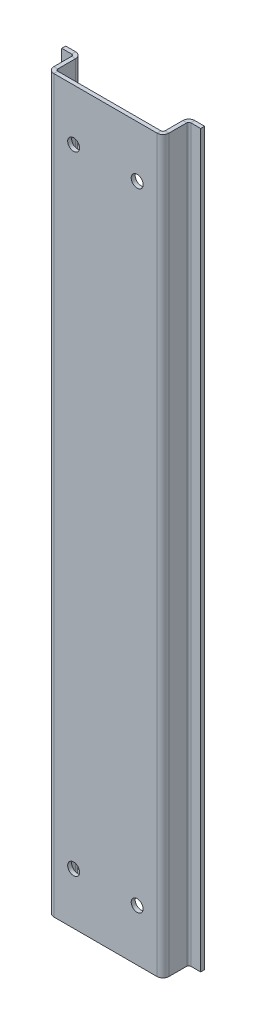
ISO-10303-21;
HEADER;
FILE_DESCRIPTION(('STEP AP214'),'2;1');
FILE_NAME('part.step','',(''),(''),'','','');
FILE_SCHEMA(('AUTOMOTIVE_DESIGN { 1 0 10303 214 1 1 1 1 }'));
ENDSEC;
DATA;
#1=APPLICATION_CONTEXT('core data for automotive mechanical design processes');
#2=APPLICATION_PROTOCOL_DEFINITION('international standard','automotive_design',2000,#1);
#3=PRODUCT_CONTEXT('',#1,'mechanical');
#4=PRODUCT('Part','Part','',(#3));
#5=PRODUCT_RELATED_PRODUCT_CATEGORY('part','',(#4));
#6=PRODUCT_DEFINITION_FORMATION('','',#4);
#7=PRODUCT_DEFINITION_CONTEXT('part definition',#1,'design');
#8=PRODUCT_DEFINITION('design','',#6,#7);
#9=PRODUCT_DEFINITION_SHAPE('','',#8);
#10=(LENGTH_UNIT() NAMED_UNIT(*) SI_UNIT(.MILLI.,.METRE.));
#11=(NAMED_UNIT(*) PLANE_ANGLE_UNIT() SI_UNIT($,.RADIAN.));
#12=(NAMED_UNIT(*) SI_UNIT($,.STERADIAN.) SOLID_ANGLE_UNIT());
#13=UNCERTAINTY_MEASURE_WITH_UNIT(LENGTH_MEASURE(1.E-05),#10,'distance_accuracy_value','');
#14=(GEOMETRIC_REPRESENTATION_CONTEXT(3) GLOBAL_UNCERTAINTY_ASSIGNED_CONTEXT((#13)) GLOBAL_UNIT_ASSIGNED_CONTEXT((#10,
#11,#12)) REPRESENTATION_CONTEXT('',''));
#15=CARTESIAN_POINT('',(0.,0.,0.));
#16=DIRECTION('',(0.,0.,1.));
#17=DIRECTION('',(1.,0.,0.));
#18=AXIS2_PLACEMENT_3D('',#15,#16,#17);
#19=CARTESIAN_POINT('',(0.,0.,-7.5));
#20=DIRECTION('',(0.,-1.,0.));
#21=DIRECTION('',(0.,0.,-1.));
#22=AXIS2_PLACEMENT_3D('',#19,#20,#21);
#23=PLANE('',#22);
#24=DIRECTION('',(0.,0.,-1.));
#25=VECTOR('',#24,1.);
#26=CARTESIAN_POINT('',(0.,0.,-7.5));
#27=LINE('',#26,#25);
#28=CARTESIAN_POINT('',(0.,0.,-1.49999999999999));
#29=VERTEX_POINT('',#28);
#30=CARTESIAN_POINT('',(0.,0.,-6.));
#31=VERTEX_POINT('',#30);
#32=EDGE_CURVE('E418',#29,#31,#27,.T.);
#33=ORIENTED_EDGE('',*,*,#32,.T.);
#34=DIRECTION('',(1.,0.,0.));
#35=VECTOR('',#34,1.);
#36=CARTESIAN_POINT('',(0.,0.,-6.));
#37=LINE('',#36,#35);
#38=CARTESIAN_POINT('',(0.999999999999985,0.,-6.00000000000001));
#39=VERTEX_POINT('',#38);
#40=EDGE_CURVE('E305',#31,#39,#37,.T.);
#41=ORIENTED_EDGE('',*,*,#40,.T.);
#42=DIRECTION('',(0.,0.,1.));
#43=VECTOR('',#42,1.);
#44=CARTESIAN_POINT('',(1.,0.,-1.));
#45=LINE('',#44,#43);
#46=CARTESIAN_POINT('',(0.999999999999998,0.,-1.5));
#47=VERTEX_POINT('',#46);
#48=EDGE_CURVE('E422',#47,#39,#45,.F.);
#49=ORIENTED_EDGE('',*,*,#48,.F.);
#50=DIRECTION('',(-1.,0.,0.));
#51=VECTOR('',#50,1.);
#52=CARTESIAN_POINT('',(0.,0.,-1.49999999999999));
#53=LINE('',#52,#51);
#54=EDGE_CURVE('E412',#47,#29,#53,.T.);
#55=ORIENTED_EDGE('',*,*,#54,.T.);
#56=EDGE_LOOP('',(#33,#41,#49,#55));
#57=FACE_BOUND('',#56,.T.);
#58=ADVANCED_FACE('F116',(#57),#23,.T.);
#59=CARTESIAN_POINT('',(0.,184.,-0.999999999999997));
#60=DIRECTION('',(-1.,0.,0.));
#61=DIRECTION('',(0.,0.,1.));
#62=AXIS2_PLACEMENT_3D('',#59,#60,#61);
#63=PLANE('',#62);
#64=DIRECTION('',(0.,0.,1.));
#65=VECTOR('',#64,1.);
#66=CARTESIAN_POINT('',(0.,184.,-0.999999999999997));
#67=LINE('',#66,#65);
#68=CARTESIAN_POINT('',(0.,184.,-6.));
#69=VERTEX_POINT('',#68);
#70=CARTESIAN_POINT('',(0.,184.,-1.49999999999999));
#71=VERTEX_POINT('',#70);
#72=EDGE_CURVE('E415',#69,#71,#67,.T.);
#73=ORIENTED_EDGE('',*,*,#72,.F.);
#74=DIRECTION('',(0.,-1.,0.));
#75=VECTOR('',#74,1.);
#76=CARTESIAN_POINT('',(0.,0.,-6.));
#77=LINE('',#76,#75);
#78=EDGE_CURVE('E140',#31,#69,#77,.F.);
#79=ORIENTED_EDGE('',*,*,#78,.F.);
#80=ORIENTED_EDGE('',*,*,#32,.F.);
#81=DIRECTION('',(0.,1.,0.));
#82=VECTOR('',#81,1.);
#83=CARTESIAN_POINT('',(0.,184.,-1.49999999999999));
#84=LINE('',#83,#82);
#85=EDGE_CURVE('E425',#29,#71,#84,.T.);
#86=ORIENTED_EDGE('',*,*,#85,.T.);
#87=EDGE_LOOP('',(#73,#79,#80,#86));
#88=FACE_BOUND('',#87,.T.);
#89=ADVANCED_FACE('F524',(#88),#63,.T.);
#90=CARTESIAN_POINT('',(1.,184.,-1.));
#91=DIRECTION('',(-1.,0.,0.));
#92=DIRECTION('',(0.,0.,1.));
#93=AXIS2_PLACEMENT_3D('',#90,#91,#92);
#94=PLANE('',#93);
#95=DIRECTION('',(0.,-1.,0.));
#96=VECTOR('',#95,1.);
#97=CARTESIAN_POINT('',(0.999999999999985,0.,-6.00000000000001));
#98=LINE('',#97,#96);
#99=CARTESIAN_POINT('',(0.999999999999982,184.,-6.));
#100=VERTEX_POINT('',#99);
#101=EDGE_CURVE('E299',#39,#100,#98,.F.);
#102=ORIENTED_EDGE('',*,*,#101,.T.);
#103=DIRECTION('',(0.,0.,-1.));
#104=VECTOR('',#103,1.);
#105=CARTESIAN_POINT('',(1.,184.,-1.));
#106=LINE('',#105,#104);
#107=CARTESIAN_POINT('',(0.999999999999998,184.,-1.5));
#108=VERTEX_POINT('',#107);
#109=EDGE_CURVE('E420',#100,#108,#106,.F.);
#110=ORIENTED_EDGE('',*,*,#109,.T.);
#111=DIRECTION('',(0.,-1.,0.));
#112=VECTOR('',#111,1.);
#113=CARTESIAN_POINT('',(0.999999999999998,0.,-1.5));
#114=LINE('',#113,#112);
#115=EDGE_CURVE('E431',#47,#108,#114,.F.);
#116=ORIENTED_EDGE('',*,*,#115,.F.);
#117=ORIENTED_EDGE('',*,*,#48,.T.);
#118=EDGE_LOOP('',(#102,#110,#116,#117));
#119=FACE_BOUND('',#118,.T.);
#120=ADVANCED_FACE('F505',(#119),#94,.F.);
#121=CARTESIAN_POINT('',(29.,184.,-7.5));
#122=DIRECTION('',(0.,1.,0.));
#123=DIRECTION('',(-1.,0.,0.));
#124=AXIS2_PLACEMENT_3D('',#121,#122,#123);
#125=PLANE('',#124);
#126=DIRECTION('',(0.,0.,-1.));
#127=VECTOR('',#126,1.);
#128=CARTESIAN_POINT('',(29.,184.,-7.5));
#129=LINE('',#128,#127);
#130=CARTESIAN_POINT('',(29.,184.,-1.49999999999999));
#131=VERTEX_POINT('',#130);
#132=CARTESIAN_POINT('',(29.,184.,-6.));
#133=VERTEX_POINT('',#132);
#134=EDGE_CURVE('E373',#131,#133,#129,.T.);
#135=ORIENTED_EDGE('',*,*,#134,.T.);
#136=DIRECTION('',(-1.,0.,0.));
#137=VECTOR('',#136,1.);
#138=CARTESIAN_POINT('',(29.,184.,-6.));
#139=LINE('',#138,#137);
#140=CARTESIAN_POINT('',(28.,184.,-6.00000000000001));
#141=VERTEX_POINT('',#140);
#142=EDGE_CURVE('E354',#133,#141,#139,.T.);
#143=ORIENTED_EDGE('',*,*,#142,.T.);
#144=DIRECTION('',(0.,0.,1.));
#145=VECTOR('',#144,1.);
#146=CARTESIAN_POINT('',(28.,184.,-1.));
#147=LINE('',#146,#145);
#148=CARTESIAN_POINT('',(28.,184.,-1.5));
#149=VERTEX_POINT('',#148);
#150=EDGE_CURVE('E378',#149,#141,#147,.F.);
#151=ORIENTED_EDGE('',*,*,#150,.F.);
#152=DIRECTION('',(1.,0.,0.));
#153=VECTOR('',#152,1.);
#154=CARTESIAN_POINT('',(29.,184.,-1.49999999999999));
#155=LINE('',#154,#153);
#156=EDGE_CURVE('E368',#149,#131,#155,.T.);
#157=ORIENTED_EDGE('',*,*,#156,.T.);
#158=EDGE_LOOP('',(#135,#143,#151,#157));
#159=FACE_BOUND('',#158,.T.);
#160=ADVANCED_FACE('F582',(#159),#125,.T.);
#161=CARTESIAN_POINT('',(29.,0.,-0.999999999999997));
#162=DIRECTION('',(1.,0.,0.));
#163=DIRECTION('',(0.,0.,-1.));
#164=AXIS2_PLACEMENT_3D('',#161,#162,#163);
#165=PLANE('',#164);
#166=DIRECTION('',(0.,0.,1.));
#167=VECTOR('',#166,1.);
#168=CARTESIAN_POINT('',(29.,0.,-0.999999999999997));
#169=LINE('',#168,#167);
#170=CARTESIAN_POINT('',(29.,0.,-6.));
#171=VERTEX_POINT('',#170);
#172=CARTESIAN_POINT('',(29.,0.,-1.49999999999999));
#173=VERTEX_POINT('',#172);
#174=EDGE_CURVE('E370',#171,#173,#169,.T.);
#175=ORIENTED_EDGE('',*,*,#174,.F.);
#176=DIRECTION('',(0.,1.,0.));
#177=VECTOR('',#176,1.);
#178=CARTESIAN_POINT('',(29.,184.,-6.));
#179=LINE('',#178,#177);
#180=EDGE_CURVE('E360',#133,#171,#179,.F.);
#181=ORIENTED_EDGE('',*,*,#180,.F.);
#182=ORIENTED_EDGE('',*,*,#134,.F.);
#183=DIRECTION('',(0.,-1.,0.));
#184=VECTOR('',#183,1.);
#185=CARTESIAN_POINT('',(29.,0.,-1.49999999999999));
#186=LINE('',#185,#184);
#187=EDGE_CURVE('E381',#131,#173,#186,.T.);
#188=ORIENTED_EDGE('',*,*,#187,.T.);
#189=EDGE_LOOP('',(#175,#181,#182,#188));
#190=FACE_BOUND('',#189,.T.);
#191=ADVANCED_FACE('F586',(#190),#165,.T.);
#192=CARTESIAN_POINT('',(28.,0.,-1.));
#193=DIRECTION('',(1.,0.,0.));
#194=DIRECTION('',(0.,0.,-1.));
#195=AXIS2_PLACEMENT_3D('',#192,#193,#194);
#196=PLANE('',#195);
#197=DIRECTION('',(0.,1.,0.));
#198=VECTOR('',#197,1.);
#199=CARTESIAN_POINT('',(28.,184.,-6.00000000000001));
#200=LINE('',#199,#198);
#201=CARTESIAN_POINT('',(28.,0.,-6.));
#202=VERTEX_POINT('',#201);
#203=EDGE_CURVE('E348',#141,#202,#200,.F.);
#204=ORIENTED_EDGE('',*,*,#203,.T.);
#205=DIRECTION('',(0.,0.,-1.));
#206=VECTOR('',#205,1.);
#207=CARTESIAN_POINT('',(28.,0.,-1.));
#208=LINE('',#207,#206);
#209=CARTESIAN_POINT('',(28.,0.,-1.5));
#210=VERTEX_POINT('',#209);
#211=EDGE_CURVE('E376',#202,#210,#208,.F.);
#212=ORIENTED_EDGE('',*,*,#211,.T.);
#213=DIRECTION('',(0.,1.,0.));
#214=VECTOR('',#213,1.);
#215=CARTESIAN_POINT('',(28.,184.,-1.5));
#216=LINE('',#215,#214);
#217=EDGE_CURVE('E387',#149,#210,#216,.F.);
#218=ORIENTED_EDGE('',*,*,#217,.F.);
#219=ORIENTED_EDGE('',*,*,#150,.T.);
#220=EDGE_LOOP('',(#204,#212,#218,#219));
#221=FACE_BOUND('',#220,.T.);
#222=ADVANCED_FACE('F555',(#221),#196,.F.);
#223=CARTESIAN_POINT('',(0.,184.,-1.));
#224=DIRECTION('',(0.,0.,-1.));
#225=DIRECTION('',(-1.,0.,0.));
#226=AXIS2_PLACEMENT_3D('',#223,#224,#225);
#227=PLANE('',#226);
#228=CARTESIAN_POINT('',(22.5000000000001,171.,-1.));
#229=DIRECTION('',(0.,0.,-1.));
#230=DIRECTION('',(1.,0.,0.));
#231=AXIS2_PLACEMENT_3D('',#228,#229,#230);
#232=CIRCLE('',#231,1.5);
#233=CARTESIAN_POINT('',(24.0000000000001,171.,-1.));
#234=VERTEX_POINT('',#233);
#235=EDGE_CURVE('E482',#234,#234,#232,.T.);
#236=ORIENTED_EDGE('',*,*,#235,.F.);
#237=EDGE_LOOP('',(#236));
#238=FACE_BOUND('',#237,.T.);
#239=CARTESIAN_POINT('',(6.50000000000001,171.,-1.));
#240=DIRECTION('',(0.,0.,-1.));
#241=DIRECTION('',(-1.,0.,0.));
#242=AXIS2_PLACEMENT_3D('',#239,#240,#241);
#243=CIRCLE('',#242,1.5);
#244=CARTESIAN_POINT('',(5.00000000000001,171.,-1.));
#245=VERTEX_POINT('',#244);
#246=EDGE_CURVE('E472',#245,#245,#243,.T.);
#247=ORIENTED_EDGE('',*,*,#246,.F.);
#248=EDGE_LOOP('',(#247));
#249=FACE_BOUND('',#248,.T.);
#250=CARTESIAN_POINT('',(6.49999999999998,13.,-1.));
#251=DIRECTION('',(0.,0.,-1.));
#252=DIRECTION('',(1.,0.,0.));
#253=AXIS2_PLACEMENT_3D('',#250,#251,#252);
#254=CIRCLE('',#253,1.5);
#255=CARTESIAN_POINT('',(7.99999999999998,13.,-1.));
#256=VERTEX_POINT('',#255);
#257=EDGE_CURVE('E469',#256,#256,#254,.T.);
#258=ORIENTED_EDGE('',*,*,#257,.F.);
#259=EDGE_LOOP('',(#258));
#260=FACE_BOUND('',#259,.T.);
#261=CARTESIAN_POINT('',(22.5,13.,-1.));
#262=DIRECTION('',(0.,0.,-1.));
#263=DIRECTION('',(-1.,0.,0.));
#264=AXIS2_PLACEMENT_3D('',#261,#262,#263);
#265=CIRCLE('',#264,1.5);
#266=CARTESIAN_POINT('',(21.,13.,-1.));
#267=VERTEX_POINT('',#266);
#268=EDGE_CURVE('E466',#267,#267,#265,.T.);
#269=ORIENTED_EDGE('',*,*,#268,.F.);
#270=EDGE_LOOP('',(#269));
#271=FACE_BOUND('',#270,.T.);
#272=DIRECTION('',(-1.,0.,0.));
#273=VECTOR('',#272,1.);
#274=CARTESIAN_POINT('',(0.,184.,-1.));
#275=LINE('',#274,#273);
#276=CARTESIAN_POINT('',(27.5,184.,-0.999999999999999));
#277=VERTEX_POINT('',#276);
#278=CARTESIAN_POINT('',(1.5,184.,-1.));
#279=VERTEX_POINT('',#278);
#280=EDGE_CURVE('E13',#277,#279,#275,.T.);
#281=ORIENTED_EDGE('',*,*,#280,.F.);
#282=DIRECTION('',(0.,-1.,0.));
#283=VECTOR('',#282,1.);
#284=CARTESIAN_POINT('',(27.5,0.,-0.999999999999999));
#285=LINE('',#284,#283);
#286=CARTESIAN_POINT('',(27.5,0.,-0.999999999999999));
#287=VERTEX_POINT('',#286);
#288=EDGE_CURVE('E404',#287,#277,#285,.F.);
#289=ORIENTED_EDGE('',*,*,#288,.F.);
#290=DIRECTION('',(1.,0.,0.));
#291=VECTOR('',#290,1.);
#292=CARTESIAN_POINT('',(0.,0.,-1.));
#293=LINE('',#292,#291);
#294=CARTESIAN_POINT('',(1.5,0.,-1.));
#295=VERTEX_POINT('',#294);
#296=EDGE_CURVE('E125',#295,#287,#293,.T.);
#297=ORIENTED_EDGE('',*,*,#296,.F.);
#298=DIRECTION('',(0.,1.,0.));
#299=VECTOR('',#298,1.);
#300=CARTESIAN_POINT('',(1.5,184.,-1.));
#301=LINE('',#300,#299);
#302=EDGE_CURVE('E448',#279,#295,#301,.F.);
#303=ORIENTED_EDGE('',*,*,#302,.F.);
#304=EDGE_LOOP('',(#281,#289,#297,#303));
#305=FACE_BOUND('',#304,.T.);
#306=ADVANCED_FACE('F551',(#238,#249,#260,#271,#305),#227,.T.);
#307=CARTESIAN_POINT('',(0.,184.,0.));
#308=DIRECTION('',(0.,0.,-1.));
#309=DIRECTION('',(-1.,0.,0.));
#310=AXIS2_PLACEMENT_3D('',#307,#308,#309);
#311=PLANE('',#310);
#312=CARTESIAN_POINT('',(22.5000000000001,171.,0.));
#313=DIRECTION('',(0.,0.,-1.));
#314=DIRECTION('',(-1.,0.,0.));
#315=AXIS2_PLACEMENT_3D('',#312,#313,#314);
#316=CIRCLE('',#315,1.5);
#317=CARTESIAN_POINT('',(21.0000000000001,171.,0.));
#318=VERTEX_POINT('',#317);
#319=EDGE_CURVE('E120',#318,#318,#316,.T.);
#320=ORIENTED_EDGE('',*,*,#319,.T.);
#321=EDGE_LOOP('',(#320));
#322=FACE_BOUND('',#321,.T.);
#323=CARTESIAN_POINT('',(6.50000000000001,171.,0.));
#324=DIRECTION('',(0.,0.,-1.));
#325=DIRECTION('',(-1.,0.,0.));
#326=AXIS2_PLACEMENT_3D('',#323,#324,#325);
#327=CIRCLE('',#326,1.5);
#328=CARTESIAN_POINT('',(5.00000000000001,171.,0.));
#329=VERTEX_POINT('',#328);
#330=EDGE_CURVE('E470',#329,#329,#327,.T.);
#331=ORIENTED_EDGE('',*,*,#330,.T.);
#332=EDGE_LOOP('',(#331));
#333=FACE_BOUND('',#332,.T.);
#334=CARTESIAN_POINT('',(6.49999999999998,13.,0.));
#335=DIRECTION('',(0.,0.,-1.));
#336=DIRECTION('',(-1.,0.,0.));
#337=AXIS2_PLACEMENT_3D('',#334,#335,#336);
#338=CIRCLE('',#337,1.5);
#339=CARTESIAN_POINT('',(4.99999999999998,13.,0.));
#340=VERTEX_POINT('',#339);
#341=EDGE_CURVE('E467',#340,#340,#338,.T.);
#342=ORIENTED_EDGE('',*,*,#341,.T.);
#343=EDGE_LOOP('',(#342));
#344=FACE_BOUND('',#343,.T.);
#345=CARTESIAN_POINT('',(22.5,13.,0.));
#346=DIRECTION('',(0.,0.,-1.));
#347=DIRECTION('',(-1.,0.,0.));
#348=AXIS2_PLACEMENT_3D('',#345,#346,#347);
#349=CIRCLE('',#348,1.5);
#350=CARTESIAN_POINT('',(21.,13.,0.));
#351=VERTEX_POINT('',#350);
#352=EDGE_CURVE('E298',#351,#351,#349,.T.);
#353=ORIENTED_EDGE('',*,*,#352,.T.);
#354=EDGE_LOOP('',(#353));
#355=FACE_BOUND('',#354,.T.);
#356=DIRECTION('',(0.,-1.,0.));
#357=VECTOR('',#356,1.);
#358=CARTESIAN_POINT('',(27.5,0.,0.));
#359=LINE('',#358,#357);
#360=CARTESIAN_POINT('',(27.5,0.,0.));
#361=VERTEX_POINT('',#360);
#362=CARTESIAN_POINT('',(27.5,184.,0.));
#363=VERTEX_POINT('',#362);
#364=EDGE_CURVE('E392',#361,#363,#359,.F.);
#365=ORIENTED_EDGE('',*,*,#364,.T.);
#366=DIRECTION('',(-1.,0.,0.));
#367=VECTOR('',#366,1.);
#368=CARTESIAN_POINT('',(0.,184.,0.));
#369=LINE('',#368,#367);
#370=CARTESIAN_POINT('',(1.5,184.,0.));
#371=VERTEX_POINT('',#370);
#372=EDGE_CURVE('E460',#363,#371,#369,.T.);
#373=ORIENTED_EDGE('',*,*,#372,.T.);
#374=DIRECTION('',(0.,1.,0.));
#375=VECTOR('',#374,1.);
#376=CARTESIAN_POINT('',(1.5,184.,0.));
#377=LINE('',#376,#375);
#378=CARTESIAN_POINT('',(1.5,0.,0.));
#379=VERTEX_POINT('',#378);
#380=EDGE_CURVE('E436',#371,#379,#377,.F.);
#381=ORIENTED_EDGE('',*,*,#380,.T.);
#382=DIRECTION('',(1.,0.,0.));
#383=VECTOR('',#382,1.);
#384=CARTESIAN_POINT('',(0.,0.,0.));
#385=LINE('',#384,#383);
#386=EDGE_CURVE('E456',#379,#361,#385,.T.);
#387=ORIENTED_EDGE('',*,*,#386,.T.);
#388=EDGE_LOOP('',(#365,#373,#381,#387));
#389=FACE_BOUND('',#388,.T.);
#390=ADVANCED_FACE('F554',(#322,#333,#344,#355,#389),#311,.F.);
#391=CARTESIAN_POINT('',(0.,0.,-1.));
#392=DIRECTION('',(0.,-1.,0.));
#393=DIRECTION('',(0.,0.,-1.));
#394=AXIS2_PLACEMENT_3D('',#391,#392,#393);
#395=PLANE('',#394);
#396=ORIENTED_EDGE('',*,*,#296,.T.);
#397=DIRECTION('',(0.,0.,1.));
#398=VECTOR('',#397,1.);
#399=CARTESIAN_POINT('',(27.5,0.,-0.999999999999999));
#400=LINE('',#399,#398);
#401=EDGE_CURVE('E398',#287,#361,#400,.T.);
#402=ORIENTED_EDGE('',*,*,#401,.T.);
#403=ORIENTED_EDGE('',*,*,#386,.F.);
#404=DIRECTION('',(0.,0.,1.));
#405=VECTOR('',#404,1.);
#406=CARTESIAN_POINT('',(1.5,0.,-1.));
#407=LINE('',#406,#405);
#408=EDGE_CURVE('E453',#295,#379,#407,.T.);
#409=ORIENTED_EDGE('',*,*,#408,.F.);
#410=EDGE_LOOP('',(#396,#402,#403,#409));
#411=FACE_BOUND('',#410,.T.);
#412=ADVANCED_FACE('F118',(#411),#395,.T.);
#413=CARTESIAN_POINT('',(0.,184.,-1.));
#414=DIRECTION('',(0.,1.,0.));
#415=DIRECTION('',(0.,0.,1.));
#416=AXIS2_PLACEMENT_3D('',#413,#414,#415);
#417=PLANE('',#416);
#418=DIRECTION('',(0.,0.,1.));
#419=VECTOR('',#418,1.);
#420=CARTESIAN_POINT('',(27.5,184.,-0.999999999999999));
#421=LINE('',#420,#419);
#422=EDGE_CURVE('E409',#277,#363,#421,.T.);
#423=ORIENTED_EDGE('',*,*,#422,.F.);
#424=ORIENTED_EDGE('',*,*,#280,.T.);
#425=DIRECTION('',(0.,0.,1.));
#426=VECTOR('',#425,1.);
#427=CARTESIAN_POINT('',(1.5,184.,-1.));
#428=LINE('',#427,#426);
#429=EDGE_CURVE('E442',#279,#371,#428,.T.);
#430=ORIENTED_EDGE('',*,*,#429,.T.);
#431=ORIENTED_EDGE('',*,*,#372,.F.);
#432=EDGE_LOOP('',(#423,#424,#430,#431));
#433=FACE_BOUND('',#432,.T.);
#434=ADVANCED_FACE('F546',(#433),#417,.T.);
#435=CARTESIAN_POINT('',(1.5,0.,-1.5));
#436=DIRECTION('',(0.,-1.,0.));
#437=DIRECTION('',(0.,0.,-1.));
#438=AXIS2_PLACEMENT_3D('',#435,#436,#437);
#439=PLANE('',#438);
#440=ORIENTED_EDGE('',*,*,#54,.F.);
#441=CARTESIAN_POINT('',(1.5,0.,-1.5));
#442=DIRECTION('',(0.,1.,0.));
#443=DIRECTION('',(0.,0.,1.));
#444=AXIS2_PLACEMENT_3D('',#441,#442,#443);
#445=CIRCLE('',#444,0.5);
#446=EDGE_CURVE('E445',#295,#47,#445,.F.);
#447=ORIENTED_EDGE('',*,*,#446,.F.);
#448=ORIENTED_EDGE('',*,*,#408,.T.);
#449=CARTESIAN_POINT('',(1.5,0.,-1.5));
#450=DIRECTION('',(0.,1.,0.));
#451=DIRECTION('',(0.,0.,1.));
#452=AXIS2_PLACEMENT_3D('',#449,#450,#451);
#453=CIRCLE('',#452,1.5);
#454=EDGE_CURVE('E438',#379,#29,#453,.F.);
#455=ORIENTED_EDGE('',*,*,#454,.T.);
#456=EDGE_LOOP('',(#440,#447,#448,#455));
#457=FACE_BOUND('',#456,.T.);
#458=ADVANCED_FACE('F543',(#457),#439,.T.);
#459=CARTESIAN_POINT('',(1.5,184.,-1.5));
#460=DIRECTION('',(0.,-1.,0.));
#461=DIRECTION('',(0.,0.,-1.));
#462=AXIS2_PLACEMENT_3D('',#459,#460,#461);
#463=PLANE('',#462);
#464=CARTESIAN_POINT('',(1.5,184.,-1.5));
#465=DIRECTION('',(0.,1.,0.));
#466=DIRECTION('',(0.,0.,1.));
#467=AXIS2_PLACEMENT_3D('',#464,#465,#466);
#468=CIRCLE('',#467,0.5);
#469=EDGE_CURVE('E417',#108,#279,#468,.T.);
#470=ORIENTED_EDGE('',*,*,#469,.F.);
#471=DIRECTION('',(-1.,0.,0.));
#472=VECTOR('',#471,1.);
#473=CARTESIAN_POINT('',(0.999999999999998,184.,-1.5));
#474=LINE('',#473,#472);
#475=EDGE_CURVE('E428',#108,#71,#474,.T.);
#476=ORIENTED_EDGE('',*,*,#475,.T.);
#477=CARTESIAN_POINT('',(1.5,184.,-1.5));
#478=DIRECTION('',(0.,1.,0.));
#479=DIRECTION('',(0.,0.,1.));
#480=AXIS2_PLACEMENT_3D('',#477,#478,#479);
#481=CIRCLE('',#480,1.5);
#482=EDGE_CURVE('E439',#71,#371,#481,.T.);
#483=ORIENTED_EDGE('',*,*,#482,.T.);
#484=ORIENTED_EDGE('',*,*,#429,.F.);
#485=EDGE_LOOP('',(#470,#476,#483,#484));
#486=FACE_BOUND('',#485,.T.);
#487=ADVANCED_FACE('F538',(#486),#463,.F.);
#488=CARTESIAN_POINT('',(1.5,184.,-1.5));
#489=DIRECTION('',(0.,1.,0.));
#490=DIRECTION('',(-1.,0.,0.));
#491=AXIS2_PLACEMENT_3D('',#488,#489,#490);
#492=CYLINDRICAL_SURFACE('',#491,1.5);
#493=ORIENTED_EDGE('',*,*,#380,.F.);
#494=ORIENTED_EDGE('',*,*,#482,.F.);
#495=ORIENTED_EDGE('',*,*,#85,.F.);
#496=ORIENTED_EDGE('',*,*,#454,.F.);
#497=EDGE_LOOP('',(#493,#494,#495,#496));
#498=FACE_BOUND('',#497,.T.);
#499=ADVANCED_FACE('F534',(#498),#492,.T.);
#500=CARTESIAN_POINT('',(1.5,184.,-1.5));
#501=DIRECTION('',(0.,1.,0.));
#502=DIRECTION('',(-1.,0.,0.));
#503=AXIS2_PLACEMENT_3D('',#500,#501,#502);
#504=CYLINDRICAL_SURFACE('',#503,0.5);
#505=ORIENTED_EDGE('',*,*,#302,.T.);
#506=ORIENTED_EDGE('',*,*,#446,.T.);
#507=ORIENTED_EDGE('',*,*,#115,.T.);
#508=ORIENTED_EDGE('',*,*,#469,.T.);
#509=EDGE_LOOP('',(#505,#506,#507,#508));
#510=FACE_BOUND('',#509,.T.);
#511=ADVANCED_FACE('F537',(#510),#504,.F.);
#512=CARTESIAN_POINT('',(0.,184.,-0.999999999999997));
#513=DIRECTION('',(0.,1.,0.));
#514=DIRECTION('',(0.,0.,1.));
#515=AXIS2_PLACEMENT_3D('',#512,#513,#514);
#516=PLANE('',#515);
#517=DIRECTION('',(1.,0.,0.));
#518=VECTOR('',#517,1.);
#519=CARTESIAN_POINT('',(0.,184.,-6.));
#520=LINE('',#519,#518);
#521=EDGE_CURVE('E133',#69,#100,#520,.T.);
#522=ORIENTED_EDGE('',*,*,#521,.F.);
#523=ORIENTED_EDGE('',*,*,#72,.T.);
#524=ORIENTED_EDGE('',*,*,#475,.F.);
#525=ORIENTED_EDGE('',*,*,#109,.F.);
#526=EDGE_LOOP('',(#522,#523,#524,#525));
#527=FACE_BOUND('',#526,.T.);
#528=ADVANCED_FACE('F532',(#527),#516,.T.);
#529=CARTESIAN_POINT('',(27.5,184.,-1.5));
#530=DIRECTION('',(0.,1.,0.));
#531=DIRECTION('',(0.,0.,1.));
#532=AXIS2_PLACEMENT_3D('',#529,#530,#531);
#533=PLANE('',#532);
#534=ORIENTED_EDGE('',*,*,#156,.F.);
#535=CARTESIAN_POINT('',(27.5,184.,-1.5));
#536=DIRECTION('',(0.,-1.,0.));
#537=DIRECTION('',(0.,0.,-1.));
#538=AXIS2_PLACEMENT_3D('',#535,#536,#537);
#539=CIRCLE('',#538,0.5);
#540=EDGE_CURVE('E401',#277,#149,#539,.F.);
#541=ORIENTED_EDGE('',*,*,#540,.F.);
#542=ORIENTED_EDGE('',*,*,#422,.T.);
#543=CARTESIAN_POINT('',(27.5,184.,-1.5));
#544=DIRECTION('',(0.,-1.,0.));
#545=DIRECTION('',(0.,0.,-1.));
#546=AXIS2_PLACEMENT_3D('',#543,#544,#545);
#547=CIRCLE('',#546,1.5);
#548=EDGE_CURVE('E394',#363,#131,#547,.F.);
#549=ORIENTED_EDGE('',*,*,#548,.T.);
#550=EDGE_LOOP('',(#534,#541,#542,#549));
#551=FACE_BOUND('',#550,.T.);
#552=ADVANCED_FACE('F578',(#551),#533,.T.);
#553=CARTESIAN_POINT('',(27.5,0.,-1.5));
#554=DIRECTION('',(0.,1.,0.));
#555=DIRECTION('',(0.,0.,1.));
#556=AXIS2_PLACEMENT_3D('',#553,#554,#555);
#557=PLANE('',#556);
#558=CARTESIAN_POINT('',(27.5,0.,-1.5));
#559=DIRECTION('',(0.,-1.,0.));
#560=DIRECTION('',(0.,0.,-1.));
#561=AXIS2_PLACEMENT_3D('',#558,#559,#560);
#562=CIRCLE('',#561,0.5);
#563=EDGE_CURVE('E372',#210,#287,#562,.T.);
#564=ORIENTED_EDGE('',*,*,#563,.F.);
#565=DIRECTION('',(1.,0.,0.));
#566=VECTOR('',#565,1.);
#567=CARTESIAN_POINT('',(28.,0.,-1.5));
#568=LINE('',#567,#566);
#569=EDGE_CURVE('E384',#210,#173,#568,.T.);
#570=ORIENTED_EDGE('',*,*,#569,.T.);
#571=CARTESIAN_POINT('',(27.5,0.,-1.5));
#572=DIRECTION('',(0.,-1.,0.));
#573=DIRECTION('',(0.,0.,-1.));
#574=AXIS2_PLACEMENT_3D('',#571,#572,#573);
#575=CIRCLE('',#574,1.5);
#576=EDGE_CURVE('E395',#173,#361,#575,.T.);
#577=ORIENTED_EDGE('',*,*,#576,.T.);
#578=ORIENTED_EDGE('',*,*,#401,.F.);
#579=EDGE_LOOP('',(#564,#570,#577,#578));
#580=FACE_BOUND('',#579,.T.);
#581=ADVANCED_FACE('F645',(#580),#557,.F.);
#582=CARTESIAN_POINT('',(27.5,0.,-1.5));
#583=DIRECTION('',(0.,-1.,0.));
#584=DIRECTION('',(1.,0.,0.));
#585=AXIS2_PLACEMENT_3D('',#582,#583,#584);
#586=CYLINDRICAL_SURFACE('',#585,1.5);
#587=ORIENTED_EDGE('',*,*,#364,.F.);
#588=ORIENTED_EDGE('',*,*,#576,.F.);
#589=ORIENTED_EDGE('',*,*,#187,.F.);
#590=ORIENTED_EDGE('',*,*,#548,.F.);
#591=EDGE_LOOP('',(#587,#588,#589,#590));
#592=FACE_BOUND('',#591,.T.);
#593=ADVANCED_FACE('F642',(#592),#586,.T.);
#594=CARTESIAN_POINT('',(27.5,0.,-1.5));
#595=DIRECTION('',(0.,-1.,0.));
#596=DIRECTION('',(1.,0.,0.));
#597=AXIS2_PLACEMENT_3D('',#594,#595,#596);
#598=CYLINDRICAL_SURFACE('',#597,0.5);
#599=ORIENTED_EDGE('',*,*,#288,.T.);
#600=ORIENTED_EDGE('',*,*,#540,.T.);
#601=ORIENTED_EDGE('',*,*,#217,.T.);
#602=ORIENTED_EDGE('',*,*,#563,.T.);
#603=EDGE_LOOP('',(#599,#600,#601,#602));
#604=FACE_BOUND('',#603,.T.);
#605=ADVANCED_FACE('F575',(#604),#598,.F.);
#606=CARTESIAN_POINT('',(29.,0.,-0.999999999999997));
#607=DIRECTION('',(0.,-1.,0.));
#608=DIRECTION('',(0.,0.,-1.));
#609=AXIS2_PLACEMENT_3D('',#606,#607,#608);
#610=PLANE('',#609);
#611=DIRECTION('',(-1.,0.,0.));
#612=VECTOR('',#611,1.);
#613=CARTESIAN_POINT('',(29.,0.,-6.));
#614=LINE('',#613,#612);
#615=EDGE_CURVE('E365',#171,#202,#614,.T.);
#616=ORIENTED_EDGE('',*,*,#615,.F.);
#617=ORIENTED_EDGE('',*,*,#174,.T.);
#618=ORIENTED_EDGE('',*,*,#569,.F.);
#619=ORIENTED_EDGE('',*,*,#211,.F.);
#620=EDGE_LOOP('',(#616,#617,#618,#619));
#621=FACE_BOUND('',#620,.T.);
#622=ADVANCED_FACE('F629',(#621),#610,.T.);
#623=CARTESIAN_POINT('',(29.5,0.,-6.));
#624=DIRECTION('',(0.,-1.,0.));
#625=DIRECTION('',(0.,0.,-1.));
#626=AXIS2_PLACEMENT_3D('',#623,#624,#625);
#627=PLANE('',#626);
#628=DIRECTION('',(0.,0.,1.));
#629=VECTOR('',#628,1.);
#630=CARTESIAN_POINT('',(29.5,0.,-7.5));
#631=LINE('',#630,#629);
#632=CARTESIAN_POINT('',(29.5,0.,-6.5));
#633=VERTEX_POINT('',#632);
#634=CARTESIAN_POINT('',(29.5,0.,-7.5));
#635=VERTEX_POINT('',#634);
#636=EDGE_CURVE('E316',#633,#635,#631,.F.);
#637=ORIENTED_EDGE('',*,*,#636,.F.);
#638=CARTESIAN_POINT('',(29.5,0.,-6.));
#639=DIRECTION('',(0.,1.,0.));
#640=DIRECTION('',(0.,0.,1.));
#641=AXIS2_PLACEMENT_3D('',#638,#639,#640);
#642=CIRCLE('',#641,0.5);
#643=EDGE_CURVE('E357',#171,#633,#642,.F.);
#644=ORIENTED_EDGE('',*,*,#643,.F.);
#645=ORIENTED_EDGE('',*,*,#615,.T.);
#646=CARTESIAN_POINT('',(29.5,0.,-6.));
#647=DIRECTION('',(0.,1.,0.));
#648=DIRECTION('',(0.,0.,1.));
#649=AXIS2_PLACEMENT_3D('',#646,#647,#648);
#650=CIRCLE('',#649,1.5);
#651=EDGE_CURVE('E350',#202,#635,#650,.F.);
#652=ORIENTED_EDGE('',*,*,#651,.T.);
#653=EDGE_LOOP('',(#637,#644,#645,#652));
#654=FACE_BOUND('',#653,.T.);
#655=ADVANCED_FACE('F593',(#654),#627,.T.);
#656=CARTESIAN_POINT('',(29.5,184.,-6.));
#657=DIRECTION('',(0.,-1.,0.));
#658=DIRECTION('',(0.,0.,-1.));
#659=AXIS2_PLACEMENT_3D('',#656,#657,#658);
#660=PLANE('',#659);
#661=CARTESIAN_POINT('',(29.5,184.,-6.));
#662=DIRECTION('',(0.,1.,0.));
#663=DIRECTION('',(0.,0.,1.));
#664=AXIS2_PLACEMENT_3D('',#661,#662,#663);
#665=CIRCLE('',#664,0.5);
#666=CARTESIAN_POINT('',(29.5,184.,-6.5));
#667=VERTEX_POINT('',#666);
#668=EDGE_CURVE('E321',#667,#133,#665,.T.);
#669=ORIENTED_EDGE('',*,*,#668,.F.);
#670=DIRECTION('',(0.,0.,1.));
#671=VECTOR('',#670,1.);
#672=CARTESIAN_POINT('',(29.5,184.,-6.5));
#673=LINE('',#672,#671);
#674=CARTESIAN_POINT('',(29.5,184.,-7.5));
#675=VERTEX_POINT('',#674);
#676=EDGE_CURVE('E341',#667,#675,#673,.F.);
#677=ORIENTED_EDGE('',*,*,#676,.T.);
#678=CARTESIAN_POINT('',(29.5,184.,-6.));
#679=DIRECTION('',(0.,1.,0.));
#680=DIRECTION('',(0.,0.,1.));
#681=AXIS2_PLACEMENT_3D('',#678,#679,#680);
#682=CIRCLE('',#681,1.5);
#683=EDGE_CURVE('E351',#675,#141,#682,.T.);
#684=ORIENTED_EDGE('',*,*,#683,.T.);
#685=ORIENTED_EDGE('',*,*,#142,.F.);
#686=EDGE_LOOP('',(#669,#677,#684,#685));
#687=FACE_BOUND('',#686,.T.);
#688=ADVANCED_FACE('F611',(#687),#660,.F.);
#689=CARTESIAN_POINT('',(29.5,184.,-6.));
#690=DIRECTION('',(0.,1.,0.));
#691=DIRECTION('',(0.,0.,-1.));
#692=AXIS2_PLACEMENT_3D('',#689,#690,#691);
#693=CYLINDRICAL_SURFACE('',#692,1.5);
#694=ORIENTED_EDGE('',*,*,#203,.F.);
#695=ORIENTED_EDGE('',*,*,#683,.F.);
#696=DIRECTION('',(0.,1.,0.));
#697=VECTOR('',#696,1.);
#698=CARTESIAN_POINT('',(29.5,0.,-7.5));
#699=LINE('',#698,#697);
#700=EDGE_CURVE('E339',#675,#635,#699,.F.);
#701=ORIENTED_EDGE('',*,*,#700,.T.);
#702=ORIENTED_EDGE('',*,*,#651,.F.);
#703=EDGE_LOOP('',(#694,#695,#701,#702));
#704=FACE_BOUND('',#703,.T.);
#705=ADVANCED_FACE('F621',(#704),#693,.T.);
#706=CARTESIAN_POINT('',(29.5,184.,-6.));
#707=DIRECTION('',(0.,1.,0.));
#708=DIRECTION('',(0.,0.,-1.));
#709=AXIS2_PLACEMENT_3D('',#706,#707,#708);
#710=CYLINDRICAL_SURFACE('',#709,0.5);
#711=ORIENTED_EDGE('',*,*,#180,.T.);
#712=ORIENTED_EDGE('',*,*,#643,.T.);
#713=DIRECTION('',(0.,1.,0.));
#714=VECTOR('',#713,1.);
#715=CARTESIAN_POINT('',(29.5,0.,-6.5));
#716=LINE('',#715,#714);
#717=EDGE_CURVE('E344',#633,#667,#716,.T.);
#718=ORIENTED_EDGE('',*,*,#717,.T.);
#719=ORIENTED_EDGE('',*,*,#668,.T.);
#720=EDGE_LOOP('',(#711,#712,#718,#719));
#721=FACE_BOUND('',#720,.T.);
#722=ADVANCED_FACE('F589',(#721),#710,.F.);
#723=CARTESIAN_POINT('',(32.,184.,-7.5));
#724=DIRECTION('',(0.,-1.,0.));
#725=DIRECTION('',(0.,0.,-1.));
#726=AXIS2_PLACEMENT_3D('',#723,#724,#725);
#727=PLANE('',#726);
#728=ORIENTED_EDGE('',*,*,#676,.F.);
#729=DIRECTION('',(-1.,0.,0.));
#730=VECTOR('',#729,1.);
#731=CARTESIAN_POINT('',(32.,184.,-6.5));
#732=LINE('',#731,#730);
#733=CARTESIAN_POINT('',(32.,184.,-6.5));
#734=VERTEX_POINT('',#733);
#735=EDGE_CURVE('E337',#667,#734,#732,.F.);
#736=ORIENTED_EDGE('',*,*,#735,.T.);
#737=DIRECTION('',(0.,0.,1.));
#738=VECTOR('',#737,1.);
#739=CARTESIAN_POINT('',(32.,184.,-7.5));
#740=LINE('',#739,#738);
#741=CARTESIAN_POINT('',(32.,184.,-7.5));
#742=VERTEX_POINT('',#741);
#743=EDGE_CURVE('E318',#742,#734,#740,.T.);
#744=ORIENTED_EDGE('',*,*,#743,.F.);
#745=DIRECTION('',(1.,0.,0.));
#746=VECTOR('',#745,1.);
#747=CARTESIAN_POINT('',(29.,184.,-7.5));
#748=LINE('',#747,#746);
#749=EDGE_CURVE('E330',#675,#742,#748,.T.);
#750=ORIENTED_EDGE('',*,*,#749,.F.);
#751=EDGE_LOOP('',(#728,#736,#744,#750));
#752=FACE_BOUND('',#751,.T.);
#753=ADVANCED_FACE('F613',(#752),#727,.F.);
#754=CARTESIAN_POINT('',(29.,0.,-7.5));
#755=DIRECTION('',(0.,1.,0.));
#756=DIRECTION('',(-1.,0.,0.));
#757=AXIS2_PLACEMENT_3D('',#754,#755,#756);
#758=PLANE('',#757);
#759=ORIENTED_EDGE('',*,*,#636,.T.);
#760=DIRECTION('',(-1.,0.,0.));
#761=VECTOR('',#760,1.);
#762=CARTESIAN_POINT('',(29.,0.,-7.5));
#763=LINE('',#762,#761);
#764=CARTESIAN_POINT('',(32.,0.,-7.5));
#765=VERTEX_POINT('',#764);
#766=EDGE_CURVE('E325',#765,#635,#763,.T.);
#767=ORIENTED_EDGE('',*,*,#766,.F.);
#768=DIRECTION('',(0.,0.,1.));
#769=VECTOR('',#768,1.);
#770=CARTESIAN_POINT('',(32.,0.,-7.5));
#771=LINE('',#770,#769);
#772=CARTESIAN_POINT('',(32.,0.,-6.5));
#773=VERTEX_POINT('',#772);
#774=EDGE_CURVE('E322',#765,#773,#771,.T.);
#775=ORIENTED_EDGE('',*,*,#774,.T.);
#776=DIRECTION('',(1.,0.,0.));
#777=VECTOR('',#776,1.);
#778=CARTESIAN_POINT('',(29.,0.,-6.5));
#779=LINE('',#778,#777);
#780=EDGE_CURVE('E332',#773,#633,#779,.F.);
#781=ORIENTED_EDGE('',*,*,#780,.T.);
#782=EDGE_LOOP('',(#759,#767,#775,#781));
#783=FACE_BOUND('',#782,.T.);
#784=ADVANCED_FACE('F597',(#783),#758,.F.);
#785=CARTESIAN_POINT('',(29.,0.,-7.5));
#786=DIRECTION('',(0.,0.,1.));
#787=DIRECTION('',(1.,0.,0.));
#788=AXIS2_PLACEMENT_3D('',#785,#786,#787);
#789=PLANE('',#788);
#790=ORIENTED_EDGE('',*,*,#700,.F.);
#791=ORIENTED_EDGE('',*,*,#749,.T.);
#792=DIRECTION('',(0.,-1.,0.));
#793=VECTOR('',#792,1.);
#794=CARTESIAN_POINT('',(32.,0.,-7.5));
#795=LINE('',#794,#793);
#796=EDGE_CURVE('E328',#742,#765,#795,.T.);
#797=ORIENTED_EDGE('',*,*,#796,.T.);
#798=ORIENTED_EDGE('',*,*,#766,.T.);
#799=EDGE_LOOP('',(#790,#791,#797,#798));
#800=FACE_BOUND('',#799,.T.);
#801=ADVANCED_FACE('F601',(#800),#789,.F.);
#802=CARTESIAN_POINT('',(29.,0.,-6.5));
#803=DIRECTION('',(0.,0.,1.));
#804=DIRECTION('',(1.,0.,0.));
#805=AXIS2_PLACEMENT_3D('',#802,#803,#804);
#806=PLANE('',#805);
#807=ORIENTED_EDGE('',*,*,#735,.F.);
#808=ORIENTED_EDGE('',*,*,#717,.F.);
#809=ORIENTED_EDGE('',*,*,#780,.F.);
#810=DIRECTION('',(0.,1.,0.));
#811=VECTOR('',#810,1.);
#812=CARTESIAN_POINT('',(32.,0.,-6.5));
#813=LINE('',#812,#811);
#814=EDGE_CURVE('E335',#734,#773,#813,.F.);
#815=ORIENTED_EDGE('',*,*,#814,.F.);
#816=EDGE_LOOP('',(#807,#808,#809,#815));
#817=FACE_BOUND('',#816,.T.);
#818=ADVANCED_FACE('F519',(#817),#806,.T.);
#819=CARTESIAN_POINT('',(32.,0.,-7.5));
#820=DIRECTION('',(-1.,0.,0.));
#821=DIRECTION('',(0.,0.,1.));
#822=AXIS2_PLACEMENT_3D('',#819,#820,#821);
#823=PLANE('',#822);
#824=ORIENTED_EDGE('',*,*,#814,.T.);
#825=ORIENTED_EDGE('',*,*,#774,.F.);
#826=ORIENTED_EDGE('',*,*,#796,.F.);
#827=ORIENTED_EDGE('',*,*,#743,.T.);
#828=EDGE_LOOP('',(#824,#825,#826,#827));
#829=FACE_BOUND('',#828,.T.);
#830=ADVANCED_FACE('F512',(#829),#823,.F.);
#831=CARTESIAN_POINT('',(-0.500000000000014,184.,-6.));
#832=DIRECTION('',(0.,1.,0.));
#833=DIRECTION('',(0.,0.,1.));
#834=AXIS2_PLACEMENT_3D('',#831,#832,#833);
#835=PLANE('',#834);
#836=DIRECTION('',(0.,0.,1.));
#837=VECTOR('',#836,1.);
#838=CARTESIAN_POINT('',(-0.500000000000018,184.,-7.5));
#839=LINE('',#838,#837);
#840=CARTESIAN_POINT('',(-0.500000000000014,184.,-6.5));
#841=VERTEX_POINT('',#840);
#842=CARTESIAN_POINT('',(-0.500000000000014,184.,-7.5));
#843=VERTEX_POINT('',#842);
#844=EDGE_CURVE('E280',#841,#843,#839,.F.);
#845=ORIENTED_EDGE('',*,*,#844,.F.);
#846=CARTESIAN_POINT('',(-0.500000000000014,184.,-6.));
#847=DIRECTION('',(0.,-1.,0.));
#848=DIRECTION('',(0.,0.,-1.));
#849=AXIS2_PLACEMENT_3D('',#846,#847,#848);
#850=CIRCLE('',#849,0.5);
#851=EDGE_CURVE('E308',#69,#841,#850,.F.);
#852=ORIENTED_EDGE('',*,*,#851,.F.);
#853=ORIENTED_EDGE('',*,*,#521,.T.);
#854=CARTESIAN_POINT('',(-0.500000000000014,184.,-6.));
#855=DIRECTION('',(0.,-1.,0.));
#856=DIRECTION('',(0.,0.,-1.));
#857=AXIS2_PLACEMENT_3D('',#854,#855,#856);
#858=CIRCLE('',#857,1.5);
#859=EDGE_CURVE('E301',#100,#843,#858,.F.);
#860=ORIENTED_EDGE('',*,*,#859,.T.);
#861=EDGE_LOOP('',(#845,#852,#853,#860));
#862=FACE_BOUND('',#861,.T.);
#863=ADVANCED_FACE('F510',(#862),#835,.T.);
#864=CARTESIAN_POINT('',(-0.500000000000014,0.,-6.));
#865=DIRECTION('',(0.,1.,0.));
#866=DIRECTION('',(0.,0.,1.));
#867=AXIS2_PLACEMENT_3D('',#864,#865,#866);
#868=PLANE('',#867);
#869=CARTESIAN_POINT('',(-0.500000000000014,0.,-6.));
#870=DIRECTION('',(0.,-1.,0.));
#871=DIRECTION('',(0.,0.,-1.));
#872=AXIS2_PLACEMENT_3D('',#869,#870,#871);
#873=CIRCLE('',#872,0.5);
#874=CARTESIAN_POINT('',(-0.500000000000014,0.,-6.5));
#875=VERTEX_POINT('',#874);
#876=EDGE_CURVE('E312',#875,#31,#873,.T.);
#877=ORIENTED_EDGE('',*,*,#876,.F.);
#878=DIRECTION('',(0.,0.,1.));
#879=VECTOR('',#878,1.);
#880=CARTESIAN_POINT('',(-0.500000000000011,0.,-6.5));
#881=LINE('',#880,#879);
#882=CARTESIAN_POINT('',(-0.500000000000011,0.,-7.5));
#883=VERTEX_POINT('',#882);
#884=EDGE_CURVE('E292',#875,#883,#881,.F.);
#885=ORIENTED_EDGE('',*,*,#884,.T.);
#886=CARTESIAN_POINT('',(-0.500000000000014,0.,-6.));
#887=DIRECTION('',(0.,-1.,0.));
#888=DIRECTION('',(0.,0.,-1.));
#889=AXIS2_PLACEMENT_3D('',#886,#887,#888);
#890=CIRCLE('',#889,1.5);
#891=EDGE_CURVE('E302',#883,#39,#890,.T.);
#892=ORIENTED_EDGE('',*,*,#891,.T.);
#893=ORIENTED_EDGE('',*,*,#40,.F.);
#894=EDGE_LOOP('',(#877,#885,#892,#893));
#895=FACE_BOUND('',#894,.T.);
#896=ADVANCED_FACE('F499',(#895),#868,.F.);
#897=CARTESIAN_POINT('',(-0.500000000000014,0.,-6.));
#898=DIRECTION('',(0.,-1.,0.));
#899=DIRECTION('',(0.,0.,-1.));
#900=AXIS2_PLACEMENT_3D('',#897,#898,#899);
#901=CYLINDRICAL_SURFACE('',#900,1.5);
#902=ORIENTED_EDGE('',*,*,#101,.F.);
#903=ORIENTED_EDGE('',*,*,#891,.F.);
#904=DIRECTION('',(0.,-1.,0.));
#905=VECTOR('',#904,1.);
#906=CARTESIAN_POINT('',(-0.500000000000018,184.,-7.5));
#907=LINE('',#906,#905);
#908=EDGE_CURVE('E290',#883,#843,#907,.F.);
#909=ORIENTED_EDGE('',*,*,#908,.T.);
#910=ORIENTED_EDGE('',*,*,#859,.F.);
#911=EDGE_LOOP('',(#902,#903,#909,#910));
#912=FACE_BOUND('',#911,.T.);
#913=ADVANCED_FACE('F508',(#912),#901,.T.);
#914=CARTESIAN_POINT('',(-0.500000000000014,0.,-6.));
#915=DIRECTION('',(0.,-1.,0.));
#916=DIRECTION('',(0.,0.,-1.));
#917=AXIS2_PLACEMENT_3D('',#914,#915,#916);
#918=CYLINDRICAL_SURFACE('',#917,0.5);
#919=ORIENTED_EDGE('',*,*,#78,.T.);
#920=ORIENTED_EDGE('',*,*,#851,.T.);
#921=DIRECTION('',(0.,-1.,0.));
#922=VECTOR('',#921,1.);
#923=CARTESIAN_POINT('',(-0.500000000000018,184.,-6.5));
#924=LINE('',#923,#922);
#925=EDGE_CURVE('E295',#841,#875,#924,.T.);
#926=ORIENTED_EDGE('',*,*,#925,.T.);
#927=ORIENTED_EDGE('',*,*,#876,.T.);
#928=EDGE_LOOP('',(#919,#920,#926,#927));
#929=FACE_BOUND('',#928,.T.);
#930=ADVANCED_FACE('F495',(#929),#918,.F.);
#931=CARTESIAN_POINT('',(-3.00000000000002,0.,-7.5));
#932=DIRECTION('',(0.,1.,0.));
#933=DIRECTION('',(0.,0.,1.));
#934=AXIS2_PLACEMENT_3D('',#931,#932,#933);
#935=PLANE('',#934);
#936=ORIENTED_EDGE('',*,*,#884,.F.);
#937=DIRECTION('',(1.,0.,0.));
#938=VECTOR('',#937,1.);
#939=CARTESIAN_POINT('',(-3.00000000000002,0.,-6.5));
#940=LINE('',#939,#938);
#941=CARTESIAN_POINT('',(-3.00000000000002,0.,-6.5));
#942=VERTEX_POINT('',#941);
#943=EDGE_CURVE('E288',#875,#942,#940,.F.);
#944=ORIENTED_EDGE('',*,*,#943,.T.);
#945=DIRECTION('',(0.,0.,1.));
#946=VECTOR('',#945,1.);
#947=CARTESIAN_POINT('',(-3.00000000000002,0.,-7.5));
#948=LINE('',#947,#946);
#949=CARTESIAN_POINT('',(-3.00000000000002,0.,-7.5));
#950=VERTEX_POINT('',#949);
#951=EDGE_CURVE('E276',#950,#942,#948,.T.);
#952=ORIENTED_EDGE('',*,*,#951,.F.);
#953=DIRECTION('',(-1.,0.,0.));
#954=VECTOR('',#953,1.);
#955=CARTESIAN_POINT('',(0.,0.,-7.5));
#956=LINE('',#955,#954);
#957=EDGE_CURVE('E263',#883,#950,#956,.T.);
#958=ORIENTED_EDGE('',*,*,#957,.F.);
#959=EDGE_LOOP('',(#936,#944,#952,#958));
#960=FACE_BOUND('',#959,.T.);
#961=ADVANCED_FACE('F488',(#960),#935,.F.);
#962=CARTESIAN_POINT('',(0.,184.,-7.5));
#963=DIRECTION('',(0.,-1.,0.));
#964=DIRECTION('',(0.,0.,-1.));
#965=AXIS2_PLACEMENT_3D('',#962,#963,#964);
#966=PLANE('',#965);
#967=ORIENTED_EDGE('',*,*,#844,.T.);
#968=DIRECTION('',(1.,0.,0.));
#969=VECTOR('',#968,1.);
#970=CARTESIAN_POINT('',(0.,184.,-7.5));
#971=LINE('',#970,#969);
#972=CARTESIAN_POINT('',(-3.00000000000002,184.,-7.5));
#973=VERTEX_POINT('',#972);
#974=EDGE_CURVE('E261',#973,#843,#971,.T.);
#975=ORIENTED_EDGE('',*,*,#974,.F.);
#976=DIRECTION('',(0.,0.,1.));
#977=VECTOR('',#976,1.);
#978=CARTESIAN_POINT('',(-3.00000000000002,184.,-7.5));
#979=LINE('',#978,#977);
#980=CARTESIAN_POINT('',(-3.00000000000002,184.,-6.5));
#981=VERTEX_POINT('',#980);
#982=EDGE_CURVE('E269',#973,#981,#979,.T.);
#983=ORIENTED_EDGE('',*,*,#982,.T.);
#984=DIRECTION('',(-1.,0.,0.));
#985=VECTOR('',#984,1.);
#986=CARTESIAN_POINT('',(0.,184.,-6.5));
#987=LINE('',#986,#985);
#988=EDGE_CURVE('E285',#981,#841,#987,.F.);
#989=ORIENTED_EDGE('',*,*,#988,.T.);
#990=EDGE_LOOP('',(#967,#975,#983,#989));
#991=FACE_BOUND('',#990,.T.);
#992=ADVANCED_FACE('F279',(#991),#966,.F.);
#993=CARTESIAN_POINT('',(0.,0.,-7.5));
#994=DIRECTION('',(0.,0.,1.));
#995=DIRECTION('',(1.,0.,0.));
#996=AXIS2_PLACEMENT_3D('',#993,#994,#995);
#997=PLANE('',#996);
#998=ORIENTED_EDGE('',*,*,#908,.F.);
#999=ORIENTED_EDGE('',*,*,#957,.T.);
#1000=DIRECTION('',(0.,1.,0.));
#1001=VECTOR('',#1000,1.);
#1002=CARTESIAN_POINT('',(-3.00000000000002,0.,-7.5));
#1003=LINE('',#1002,#1001);
#1004=EDGE_CURVE('E256',#950,#973,#1003,.T.);
#1005=ORIENTED_EDGE('',*,*,#1004,.T.);
#1006=ORIENTED_EDGE('',*,*,#974,.T.);
#1007=EDGE_LOOP('',(#998,#999,#1005,#1006));
#1008=FACE_BOUND('',#1007,.T.);
#1009=ADVANCED_FACE('F259',(#1008),#997,.F.);
#1010=CARTESIAN_POINT('',(0.,0.,-6.5));
#1011=DIRECTION('',(0.,0.,1.));
#1012=DIRECTION('',(1.,0.,0.));
#1013=AXIS2_PLACEMENT_3D('',#1010,#1011,#1012);
#1014=PLANE('',#1013);
#1015=ORIENTED_EDGE('',*,*,#943,.F.);
#1016=ORIENTED_EDGE('',*,*,#925,.F.);
#1017=ORIENTED_EDGE('',*,*,#988,.F.);
#1018=DIRECTION('',(0.,-1.,0.));
#1019=VECTOR('',#1018,1.);
#1020=CARTESIAN_POINT('',(-3.00000000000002,184.,-6.5));
#1021=LINE('',#1020,#1019);
#1022=EDGE_CURVE('E272',#942,#981,#1021,.F.);
#1023=ORIENTED_EDGE('',*,*,#1022,.F.);
#1024=EDGE_LOOP('',(#1015,#1016,#1017,#1023));
#1025=FACE_BOUND('',#1024,.T.);
#1026=ADVANCED_FACE('F492',(#1025),#1014,.T.);
#1027=CARTESIAN_POINT('',(-3.00000000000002,184.,-7.5));
#1028=DIRECTION('',(1.,0.,0.));
#1029=DIRECTION('',(0.,0.,-1.));
#1030=AXIS2_PLACEMENT_3D('',#1027,#1028,#1029);
#1031=PLANE('',#1030);
#1032=ORIENTED_EDGE('',*,*,#1022,.T.);
#1033=ORIENTED_EDGE('',*,*,#982,.F.);
#1034=ORIENTED_EDGE('',*,*,#1004,.F.);
#1035=ORIENTED_EDGE('',*,*,#951,.T.);
#1036=EDGE_LOOP('',(#1032,#1033,#1034,#1035));
#1037=FACE_BOUND('',#1036,.T.);
#1038=ADVANCED_FACE('F270',(#1037),#1031,.F.);
#1039=CARTESIAN_POINT('',(22.5,13.,9.));
#1040=DIRECTION('',(0.,0.,-1.));
#1041=DIRECTION('',(-1.,0.,0.));
#1042=AXIS2_PLACEMENT_3D('',#1039,#1040,#1041);
#1043=CYLINDRICAL_SURFACE('',#1042,1.5);
#1044=ORIENTED_EDGE('',*,*,#268,.T.);
#1045=EDGE_LOOP('',(#1044));
#1046=FACE_BOUND('',#1045,.T.);
#1047=ORIENTED_EDGE('',*,*,#352,.F.);
#1048=EDGE_LOOP('',(#1047));
#1049=FACE_BOUND('',#1048,.T.);
#1050=ADVANCED_FACE('F953',(#1046,#1049),#1043,.F.);
#1051=CARTESIAN_POINT('',(6.49999999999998,13.,9.));
#1052=DIRECTION('',(0.,0.,-1.));
#1053=DIRECTION('',(-1.,0.,0.));
#1054=AXIS2_PLACEMENT_3D('',#1051,#1052,#1053);
#1055=CYLINDRICAL_SURFACE('',#1054,1.5);
#1056=ORIENTED_EDGE('',*,*,#257,.T.);
#1057=EDGE_LOOP('',(#1056));
#1058=FACE_BOUND('',#1057,.T.);
#1059=ORIENTED_EDGE('',*,*,#341,.F.);
#1060=EDGE_LOOP('',(#1059));
#1061=FACE_BOUND('',#1060,.T.);
#1062=ADVANCED_FACE('F963',(#1058,#1061),#1055,.F.);
#1063=CARTESIAN_POINT('',(6.50000000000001,171.,9.));
#1064=DIRECTION('',(0.,0.,-1.));
#1065=DIRECTION('',(-1.,0.,0.));
#1066=AXIS2_PLACEMENT_3D('',#1063,#1064,#1065);
#1067=CYLINDRICAL_SURFACE('',#1066,1.5);
#1068=ORIENTED_EDGE('',*,*,#246,.T.);
#1069=EDGE_LOOP('',(#1068));
#1070=FACE_BOUND('',#1069,.T.);
#1071=ORIENTED_EDGE('',*,*,#330,.F.);
#1072=EDGE_LOOP('',(#1071));
#1073=FACE_BOUND('',#1072,.T.);
#1074=ADVANCED_FACE('F970',(#1070,#1073),#1067,.F.);
#1075=CARTESIAN_POINT('',(22.5000000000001,171.,9.));
#1076=DIRECTION('',(0.,0.,-1.));
#1077=DIRECTION('',(-1.,0.,0.));
#1078=AXIS2_PLACEMENT_3D('',#1075,#1076,#1077);
#1079=CYLINDRICAL_SURFACE('',#1078,1.5);
#1080=ORIENTED_EDGE('',*,*,#235,.T.);
#1081=EDGE_LOOP('',(#1080));
#1082=FACE_BOUND('',#1081,.T.);
#1083=ORIENTED_EDGE('',*,*,#319,.F.);
#1084=EDGE_LOOP('',(#1083));
#1085=FACE_BOUND('',#1084,.T.);
#1086=ADVANCED_FACE('F978',(#1082,#1085),#1079,.F.);
#1087=CLOSED_SHELL('',(#58,#89,#120,#160,#191,#222,#306,#390,#412,#434,#458,#487,#499,#511,#528,
#552,#581,#593,#605,#622,#655,#688,#705,#722,#753,#784,#801,#818,#830,#863,#896,#913,#930,#961,
#992,#1009,#1026,#1038,#1050,#1062,#1074,#1086));
#1088=MANIFOLD_SOLID_BREP('B2',#1087);
#1089=ADVANCED_BREP_SHAPE_REPRESENTATION('',(#18,#1088),#14);
#1090=SHAPE_DEFINITION_REPRESENTATION(#9,#1089);
ENDSEC;
END-ISO-10303-21;
